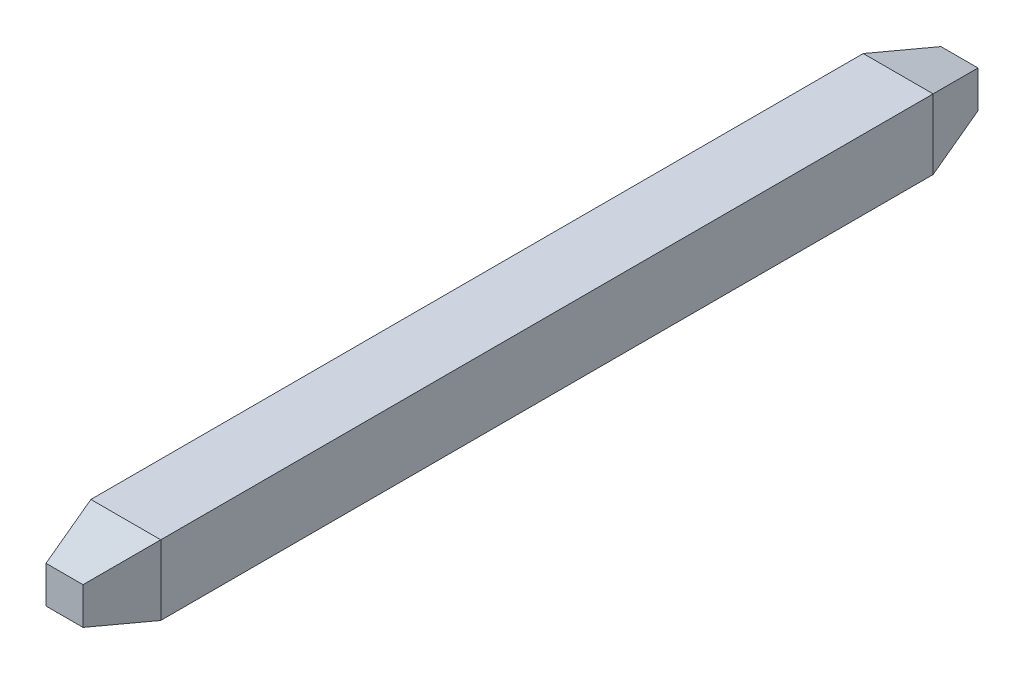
ISO-10303-21;
HEADER;
FILE_DESCRIPTION(('STEP AP214'),'2;1');
FILE_NAME('part.step','',(''),(''),'','','');
FILE_SCHEMA(('AUTOMOTIVE_DESIGN { 1 0 10303 214 1 1 1 1 }'));
ENDSEC;
DATA;
#1=APPLICATION_CONTEXT('core data for automotive mechanical design processes');
#2=APPLICATION_PROTOCOL_DEFINITION('international standard','automotive_design',2000,#1);
#3=PRODUCT_CONTEXT('',#1,'mechanical');
#4=PRODUCT('Part','Part','',(#3));
#5=PRODUCT_RELATED_PRODUCT_CATEGORY('part','',(#4));
#6=PRODUCT_DEFINITION_FORMATION('','',#4);
#7=PRODUCT_DEFINITION_CONTEXT('part definition',#1,'design');
#8=PRODUCT_DEFINITION('design','',#6,#7);
#9=PRODUCT_DEFINITION_SHAPE('','',#8);
#10=(LENGTH_UNIT() NAMED_UNIT(*) SI_UNIT(.MILLI.,.METRE.));
#11=(NAMED_UNIT(*) PLANE_ANGLE_UNIT() SI_UNIT($,.RADIAN.));
#12=(NAMED_UNIT(*) SI_UNIT($,.STERADIAN.) SOLID_ANGLE_UNIT());
#13=UNCERTAINTY_MEASURE_WITH_UNIT(LENGTH_MEASURE(1.E-05),#10,'distance_accuracy_value','');
#14=(GEOMETRIC_REPRESENTATION_CONTEXT(3) GLOBAL_UNCERTAINTY_ASSIGNED_CONTEXT((#13)) GLOBAL_UNIT_ASSIGNED_CONTEXT((#10,
#11,#12)) REPRESENTATION_CONTEXT('',''));
#15=CARTESIAN_POINT('',(0.,0.,0.));
#16=DIRECTION('',(0.,0.,1.));
#17=DIRECTION('',(1.,0.,0.));
#18=AXIS2_PLACEMENT_3D('',#15,#16,#17);
#19=CARTESIAN_POINT('',(-0.302050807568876,0.,10.9));
#20=DIRECTION('',(-0.965925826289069,0.,0.258819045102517));
#21=DIRECTION('',(0.258819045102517,0.,0.965925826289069));
#22=AXIS2_PLACEMENT_3D('',#19,#20,#21);
#23=PLANE('',#22);
#24=DIRECTION('',(0.250562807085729,-0.250562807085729,0.935113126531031));
#25=VECTOR('',#24,1.);
#26=CARTESIAN_POINT('',(-0.57,0.57,9.89999999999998));
#27=LINE('',#26,#25);
#28=CARTESIAN_POINT('',(-0.57,0.57,9.89999999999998));
#29=VERTEX_POINT('',#28);
#30=CARTESIAN_POINT('',(-0.302050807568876,0.302050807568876,10.9));
#31=VERTEX_POINT('',#30);
#32=EDGE_CURVE('E85',#29,#31,#27,.T.);
#33=ORIENTED_EDGE('',*,*,#32,.F.);
#34=DIRECTION('',(0.,1.,0.));
#35=VECTOR('',#34,1.);
#36=CARTESIAN_POINT('',(-0.57,-0.57,9.89999999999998));
#37=LINE('',#36,#35);
#38=CARTESIAN_POINT('',(-0.57,-0.57,9.89999999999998));
#39=VERTEX_POINT('',#38);
#40=EDGE_CURVE('E120',#29,#39,#37,.F.);
#41=ORIENTED_EDGE('',*,*,#40,.T.);
#42=DIRECTION('',(-0.250562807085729,-0.250562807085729,-0.935113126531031));
#43=VECTOR('',#42,1.);
#44=CARTESIAN_POINT('',(-0.302050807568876,-0.302050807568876,10.9));
#45=LINE('',#44,#43);
#46=CARTESIAN_POINT('',(-0.302050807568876,-0.302050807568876,10.9));
#47=VERTEX_POINT('',#46);
#48=EDGE_CURVE('E97',#47,#39,#45,.T.);
#49=ORIENTED_EDGE('',*,*,#48,.F.);
#50=DIRECTION('',(0.,1.,0.));
#51=VECTOR('',#50,1.);
#52=CARTESIAN_POINT('',(-0.302050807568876,0.,10.9));
#53=LINE('',#52,#51);
#54=EDGE_CURVE('E20',#31,#47,#53,.F.);
#55=ORIENTED_EDGE('',*,*,#54,.F.);
#56=EDGE_LOOP('',(#33,#41,#49,#55));
#57=FACE_BOUND('',#56,.T.);
#58=ADVANCED_FACE('F17',(#57),#23,.T.);
#59=CARTESIAN_POINT('',(-0.302050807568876,0.,-3.7));
#60=DIRECTION('',(0.965925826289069,0.,0.258819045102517));
#61=DIRECTION('',(0.258819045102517,0.,-0.965925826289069));
#62=AXIS2_PLACEMENT_3D('',#59,#60,#61);
#63=PLANE('',#62);
#64=DIRECTION('',(0.,1.,0.));
#65=VECTOR('',#64,1.);
#66=CARTESIAN_POINT('',(-0.302050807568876,0.,-3.7));
#67=LINE('',#66,#65);
#68=CARTESIAN_POINT('',(-0.302050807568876,0.302050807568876,-3.7));
#69=VERTEX_POINT('',#68);
#70=CARTESIAN_POINT('',(-0.302050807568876,-0.302050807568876,-3.7));
#71=VERTEX_POINT('',#70);
#72=EDGE_CURVE('E79',#69,#71,#67,.F.);
#73=ORIENTED_EDGE('',*,*,#72,.T.);
#74=DIRECTION('',(-0.250562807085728,-0.250562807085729,0.935113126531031));
#75=VECTOR('',#74,1.);
#76=CARTESIAN_POINT('',(-0.302050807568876,-0.302050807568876,-3.7));
#77=LINE('',#76,#75);
#78=CARTESIAN_POINT('',(-0.57,-0.57,-2.69999999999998));
#79=VERTEX_POINT('',#78);
#80=EDGE_CURVE('E117',#71,#79,#77,.T.);
#81=ORIENTED_EDGE('',*,*,#80,.T.);
#82=DIRECTION('',(0.,1.,0.));
#83=VECTOR('',#82,1.);
#84=CARTESIAN_POINT('',(-0.57,-0.57,-2.69999999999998));
#85=LINE('',#84,#83);
#86=CARTESIAN_POINT('',(-0.57,0.57,-2.69999999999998));
#87=VERTEX_POINT('',#86);
#88=EDGE_CURVE('E122',#79,#87,#85,.T.);
#89=ORIENTED_EDGE('',*,*,#88,.T.);
#90=DIRECTION('',(0.250562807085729,-0.250562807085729,-0.935113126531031));
#91=VECTOR('',#90,1.);
#92=CARTESIAN_POINT('',(-0.57,0.57,-2.69999999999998));
#93=LINE('',#92,#91);
#94=EDGE_CURVE('E109',#87,#69,#93,.T.);
#95=ORIENTED_EDGE('',*,*,#94,.T.);
#96=EDGE_LOOP('',(#73,#81,#89,#95));
#97=FACE_BOUND('',#96,.T.);
#98=ADVANCED_FACE('F212',(#97),#63,.F.);
#99=CARTESIAN_POINT('',(0.,0.,10.9));
#100=DIRECTION('',(0.,0.,1.));
#101=DIRECTION('',(1.,0.,0.));
#102=AXIS2_PLACEMENT_3D('',#99,#100,#101);
#103=PLANE('',#102);
#104=ORIENTED_EDGE('',*,*,#54,.T.);
#105=DIRECTION('',(1.,0.,0.));
#106=VECTOR('',#105,1.);
#107=CARTESIAN_POINT('',(0.,-0.302050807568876,10.9));
#108=LINE('',#107,#106);
#109=CARTESIAN_POINT('',(0.302050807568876,-0.302050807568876,10.9));
#110=VERTEX_POINT('',#109);
#111=EDGE_CURVE('E113',#110,#47,#108,.F.);
#112=ORIENTED_EDGE('',*,*,#111,.F.);
#113=DIRECTION('',(0.,1.,0.));
#114=VECTOR('',#113,1.);
#115=CARTESIAN_POINT('',(0.302050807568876,0.,10.9));
#116=LINE('',#115,#114);
#117=CARTESIAN_POINT('',(0.302050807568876,0.302050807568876,10.9));
#118=VERTEX_POINT('',#117);
#119=EDGE_CURVE('E103',#118,#110,#116,.F.);
#120=ORIENTED_EDGE('',*,*,#119,.F.);
#121=DIRECTION('',(1.,0.,0.));
#122=VECTOR('',#121,1.);
#123=CARTESIAN_POINT('',(0.,0.302050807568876,10.9));
#124=LINE('',#123,#122);
#125=EDGE_CURVE('E90',#31,#118,#124,.T.);
#126=ORIENTED_EDGE('',*,*,#125,.F.);
#127=EDGE_LOOP('',(#104,#112,#120,#126));
#128=FACE_BOUND('',#127,.T.);
#129=ADVANCED_FACE('F101',(#128),#103,.T.);
#130=CARTESIAN_POINT('',(0.,0.302050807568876,10.9));
#131=DIRECTION('',(0.,0.965925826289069,0.258819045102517));
#132=DIRECTION('',(0.,-0.258819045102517,0.965925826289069));
#133=AXIS2_PLACEMENT_3D('',#130,#131,#132);
#134=PLANE('',#133);
#135=ORIENTED_EDGE('',*,*,#32,.T.);
#136=ORIENTED_EDGE('',*,*,#125,.T.);
#137=DIRECTION('',(-0.250562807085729,-0.250562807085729,0.935113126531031));
#138=VECTOR('',#137,1.);
#139=CARTESIAN_POINT('',(0.569999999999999,0.57,9.89999999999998));
#140=LINE('',#139,#138);
#141=CARTESIAN_POINT('',(0.57,0.57,9.89999999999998));
#142=VERTEX_POINT('',#141);
#143=EDGE_CURVE('E127',#142,#118,#140,.T.);
#144=ORIENTED_EDGE('',*,*,#143,.F.);
#145=DIRECTION('',(1.,0.,0.));
#146=VECTOR('',#145,1.);
#147=CARTESIAN_POINT('',(0.57,0.57,9.89999999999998));
#148=LINE('',#147,#146);
#149=EDGE_CURVE('E92',#142,#29,#148,.F.);
#150=ORIENTED_EDGE('',*,*,#149,.T.);
#151=EDGE_LOOP('',(#135,#136,#144,#150));
#152=FACE_BOUND('',#151,.T.);
#153=ADVANCED_FACE('F87',(#152),#134,.T.);
#154=CARTESIAN_POINT('',(0.,0.,-3.7));
#155=DIRECTION('',(0.,0.,1.));
#156=DIRECTION('',(1.,0.,0.));
#157=AXIS2_PLACEMENT_3D('',#154,#155,#156);
#158=PLANE('',#157);
#159=DIRECTION('',(1.,0.,0.));
#160=VECTOR('',#159,1.);
#161=CARTESIAN_POINT('',(0.,-0.302050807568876,-3.7));
#162=LINE('',#161,#160);
#163=CARTESIAN_POINT('',(0.302050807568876,-0.302050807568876,-3.7));
#164=VERTEX_POINT('',#163);
#165=EDGE_CURVE('E115',#164,#71,#162,.F.);
#166=ORIENTED_EDGE('',*,*,#165,.T.);
#167=ORIENTED_EDGE('',*,*,#72,.F.);
#168=DIRECTION('',(1.,0.,0.));
#169=VECTOR('',#168,1.);
#170=CARTESIAN_POINT('',(0.,0.302050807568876,-3.7));
#171=LINE('',#170,#169);
#172=CARTESIAN_POINT('',(0.302050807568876,0.302050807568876,-3.7));
#173=VERTEX_POINT('',#172);
#174=EDGE_CURVE('E105',#69,#173,#171,.T.);
#175=ORIENTED_EDGE('',*,*,#174,.T.);
#176=DIRECTION('',(0.,1.,0.));
#177=VECTOR('',#176,1.);
#178=CARTESIAN_POINT('',(0.302050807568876,0.,-3.7));
#179=LINE('',#178,#177);
#180=EDGE_CURVE('E137',#173,#164,#179,.F.);
#181=ORIENTED_EDGE('',*,*,#180,.T.);
#182=EDGE_LOOP('',(#166,#167,#175,#181));
#183=FACE_BOUND('',#182,.T.);
#184=ADVANCED_FACE('F205',(#183),#158,.F.);
#185=CARTESIAN_POINT('',(0.,0.302050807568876,-3.7));
#186=DIRECTION('',(0.,-0.965925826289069,0.258819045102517));
#187=DIRECTION('',(0.,-0.258819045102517,-0.965925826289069));
#188=AXIS2_PLACEMENT_3D('',#185,#186,#187);
#189=PLANE('',#188);
#190=DIRECTION('',(1.,0.,0.));
#191=VECTOR('',#190,1.);
#192=CARTESIAN_POINT('',(0.57,0.57,-2.69999999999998));
#193=LINE('',#192,#191);
#194=CARTESIAN_POINT('',(0.57,0.57,-2.69999999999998));
#195=VERTEX_POINT('',#194);
#196=EDGE_CURVE('E134',#87,#195,#193,.T.);
#197=ORIENTED_EDGE('',*,*,#196,.T.);
#198=DIRECTION('',(-0.250562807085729,-0.250562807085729,-0.935113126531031));
#199=VECTOR('',#198,1.);
#200=CARTESIAN_POINT('',(0.57,0.57,-2.69999999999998));
#201=LINE('',#200,#199);
#202=EDGE_CURVE('E142',#195,#173,#201,.T.);
#203=ORIENTED_EDGE('',*,*,#202,.T.);
#204=ORIENTED_EDGE('',*,*,#174,.F.);
#205=ORIENTED_EDGE('',*,*,#94,.F.);
#206=EDGE_LOOP('',(#197,#203,#204,#205));
#207=FACE_BOUND('',#206,.T.);
#208=ADVANCED_FACE('F202',(#207),#189,.F.);
#209=CARTESIAN_POINT('',(0.,-0.302050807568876,10.9));
#210=DIRECTION('',(0.,-0.965925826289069,0.258819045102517));
#211=DIRECTION('',(0.,-0.258819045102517,-0.965925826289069));
#212=AXIS2_PLACEMENT_3D('',#209,#210,#211);
#213=PLANE('',#212);
#214=DIRECTION('',(0.250562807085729,-0.250562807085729,-0.935113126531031));
#215=VECTOR('',#214,1.);
#216=CARTESIAN_POINT('',(0.302050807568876,-0.302050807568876,10.9));
#217=LINE('',#216,#215);
#218=CARTESIAN_POINT('',(0.57,-0.57,9.89999999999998));
#219=VERTEX_POINT('',#218);
#220=EDGE_CURVE('E125',#110,#219,#217,.T.);
#221=ORIENTED_EDGE('',*,*,#220,.F.);
#222=ORIENTED_EDGE('',*,*,#111,.T.);
#223=ORIENTED_EDGE('',*,*,#48,.T.);
#224=DIRECTION('',(1.,0.,0.));
#225=VECTOR('',#224,1.);
#226=CARTESIAN_POINT('',(0.57,-0.57,9.89999999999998));
#227=LINE('',#226,#225);
#228=EDGE_CURVE('E145',#39,#219,#227,.T.);
#229=ORIENTED_EDGE('',*,*,#228,.T.);
#230=EDGE_LOOP('',(#221,#222,#223,#229));
#231=FACE_BOUND('',#230,.T.);
#232=ADVANCED_FACE('F176',(#231),#213,.T.);
#233=CARTESIAN_POINT('',(0.,-0.302050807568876,-3.7));
#234=DIRECTION('',(0.,0.965925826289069,0.258819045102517));
#235=DIRECTION('',(0.,-0.258819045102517,0.965925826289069));
#236=AXIS2_PLACEMENT_3D('',#233,#234,#235);
#237=PLANE('',#236);
#238=DIRECTION('',(1.,0.,0.));
#239=VECTOR('',#238,1.);
#240=CARTESIAN_POINT('',(0.57,-0.57,-2.69999999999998));
#241=LINE('',#240,#239);
#242=CARTESIAN_POINT('',(0.57,-0.57,-2.69999999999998));
#243=VERTEX_POINT('',#242);
#244=EDGE_CURVE('E34',#243,#79,#241,.F.);
#245=ORIENTED_EDGE('',*,*,#244,.T.);
#246=ORIENTED_EDGE('',*,*,#80,.F.);
#247=ORIENTED_EDGE('',*,*,#165,.F.);
#248=DIRECTION('',(0.250562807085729,-0.250562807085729,0.935113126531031));
#249=VECTOR('',#248,1.);
#250=CARTESIAN_POINT('',(0.302050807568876,-0.302050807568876,-3.7));
#251=LINE('',#250,#249);
#252=EDGE_CURVE('E140',#164,#243,#251,.T.);
#253=ORIENTED_EDGE('',*,*,#252,.T.);
#254=EDGE_LOOP('',(#245,#246,#247,#253));
#255=FACE_BOUND('',#254,.T.);
#256=ADVANCED_FACE('F195',(#255),#237,.F.);
#257=CARTESIAN_POINT('',(-0.57,-0.57,10.9));
#258=DIRECTION('',(1.,0.,0.));
#259=DIRECTION('',(0.,0.,-1.));
#260=AXIS2_PLACEMENT_3D('',#257,#258,#259);
#261=PLANE('',#260);
#262=ORIENTED_EDGE('',*,*,#88,.F.);
#263=DIRECTION('',(0.,0.,1.));
#264=VECTOR('',#263,1.);
#265=CARTESIAN_POINT('',(-0.57,-0.57,10.9));
#266=LINE('',#265,#264);
#267=EDGE_CURVE('E149',#79,#39,#266,.T.);
#268=ORIENTED_EDGE('',*,*,#267,.T.);
#269=ORIENTED_EDGE('',*,*,#40,.F.);
#270=DIRECTION('',(0.,0.,-1.));
#271=VECTOR('',#270,1.);
#272=CARTESIAN_POINT('',(-0.57,0.57,10.9));
#273=LINE('',#272,#271);
#274=EDGE_CURVE('E131',#29,#87,#273,.T.);
#275=ORIENTED_EDGE('',*,*,#274,.T.);
#276=EDGE_LOOP('',(#262,#268,#269,#275));
#277=FACE_BOUND('',#276,.T.);
#278=ADVANCED_FACE('F192',(#277),#261,.F.);
#279=CARTESIAN_POINT('',(0.302050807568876,0.,10.9));
#280=DIRECTION('',(0.965925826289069,0.,0.258819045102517));
#281=DIRECTION('',(0.258819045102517,0.,-0.965925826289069));
#282=AXIS2_PLACEMENT_3D('',#279,#280,#281);
#283=PLANE('',#282);
#284=ORIENTED_EDGE('',*,*,#143,.T.);
#285=ORIENTED_EDGE('',*,*,#119,.T.);
#286=ORIENTED_EDGE('',*,*,#220,.T.);
#287=DIRECTION('',(0.,1.,0.));
#288=VECTOR('',#287,1.);
#289=CARTESIAN_POINT('',(0.57,-0.57,9.89999999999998));
#290=LINE('',#289,#288);
#291=EDGE_CURVE('E152',#219,#142,#290,.T.);
#292=ORIENTED_EDGE('',*,*,#291,.T.);
#293=EDGE_LOOP('',(#284,#285,#286,#292));
#294=FACE_BOUND('',#293,.T.);
#295=ADVANCED_FACE('F172',(#294),#283,.T.);
#296=CARTESIAN_POINT('',(0.57,0.57,10.9));
#297=DIRECTION('',(0.,-1.,0.));
#298=DIRECTION('',(0.,0.,-1.));
#299=AXIS2_PLACEMENT_3D('',#296,#297,#298);
#300=PLANE('',#299);
#301=ORIENTED_EDGE('',*,*,#196,.F.);
#302=ORIENTED_EDGE('',*,*,#274,.F.);
#303=ORIENTED_EDGE('',*,*,#149,.F.);
#304=DIRECTION('',(0.,0.,1.));
#305=VECTOR('',#304,1.);
#306=CARTESIAN_POINT('',(0.57,0.57,10.9));
#307=LINE('',#306,#305);
#308=EDGE_CURVE('E155',#142,#195,#307,.F.);
#309=ORIENTED_EDGE('',*,*,#308,.T.);
#310=EDGE_LOOP('',(#301,#302,#303,#309));
#311=FACE_BOUND('',#310,.T.);
#312=ADVANCED_FACE('F170',(#311),#300,.F.);
#313=CARTESIAN_POINT('',(0.302050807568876,0.,-3.7));
#314=DIRECTION('',(-0.965925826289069,0.,0.258819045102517));
#315=DIRECTION('',(0.258819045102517,0.,0.965925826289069));
#316=AXIS2_PLACEMENT_3D('',#313,#314,#315);
#317=PLANE('',#316);
#318=DIRECTION('',(0.,1.,0.));
#319=VECTOR('',#318,1.);
#320=CARTESIAN_POINT('',(0.57,-0.57,-2.69999999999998));
#321=LINE('',#320,#319);
#322=EDGE_CURVE('E26',#195,#243,#321,.F.);
#323=ORIENTED_EDGE('',*,*,#322,.T.);
#324=ORIENTED_EDGE('',*,*,#252,.F.);
#325=ORIENTED_EDGE('',*,*,#180,.F.);
#326=ORIENTED_EDGE('',*,*,#202,.F.);
#327=EDGE_LOOP('',(#323,#324,#325,#326));
#328=FACE_BOUND('',#327,.T.);
#329=ADVANCED_FACE('F162',(#328),#317,.F.);
#330=CARTESIAN_POINT('',(0.57,-0.57,10.9));
#331=DIRECTION('',(0.,1.,0.));
#332=DIRECTION('',(0.,0.,1.));
#333=AXIS2_PLACEMENT_3D('',#330,#331,#332);
#334=PLANE('',#333);
#335=ORIENTED_EDGE('',*,*,#244,.F.);
#336=DIRECTION('',(0.,0.,1.));
#337=VECTOR('',#336,1.);
#338=CARTESIAN_POINT('',(0.57,-0.57,10.9));
#339=LINE('',#338,#337);
#340=EDGE_CURVE('E11',#243,#219,#339,.T.);
#341=ORIENTED_EDGE('',*,*,#340,.T.);
#342=ORIENTED_EDGE('',*,*,#228,.F.);
#343=ORIENTED_EDGE('',*,*,#267,.F.);
#344=EDGE_LOOP('',(#335,#341,#342,#343));
#345=FACE_BOUND('',#344,.T.);
#346=ADVANCED_FACE('F177',(#345),#334,.F.);
#347=CARTESIAN_POINT('',(0.57,-0.57,10.9));
#348=DIRECTION('',(-1.,0.,0.));
#349=DIRECTION('',(0.,0.,1.));
#350=AXIS2_PLACEMENT_3D('',#347,#348,#349);
#351=PLANE('',#350);
#352=ORIENTED_EDGE('',*,*,#322,.F.);
#353=ORIENTED_EDGE('',*,*,#308,.F.);
#354=ORIENTED_EDGE('',*,*,#291,.F.);
#355=ORIENTED_EDGE('',*,*,#340,.F.);
#356=EDGE_LOOP('',(#352,#353,#354,#355));
#357=FACE_BOUND('',#356,.T.);
#358=ADVANCED_FACE('F166',(#357),#351,.F.);
#359=CLOSED_SHELL('',(#58,#98,#129,#153,#184,#208,#232,#256,#278,#295,#312,#329,#346,#358));
#360=MANIFOLD_SOLID_BREP('B1',#359);
#361=ADVANCED_BREP_SHAPE_REPRESENTATION('',(#18,#360),#14);
#362=SHAPE_DEFINITION_REPRESENTATION(#9,#361);
ENDSEC;
END-ISO-10303-21;
